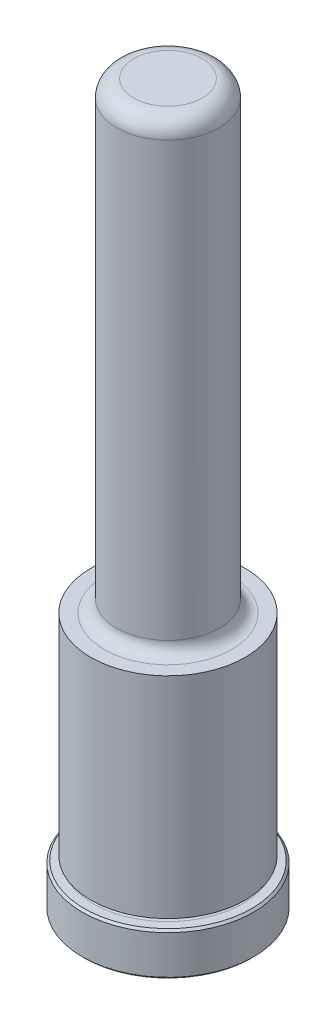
ISO-10303-21;
HEADER;
FILE_DESCRIPTION(('STEP AP214'),'2;1');
FILE_NAME('part.step','',(''),(''),'','','');
FILE_SCHEMA(('AUTOMOTIVE_DESIGN { 1 0 10303 214 1 1 1 1 }'));
ENDSEC;
DATA;
#1=APPLICATION_CONTEXT('core data for automotive mechanical design processes');
#2=APPLICATION_PROTOCOL_DEFINITION('international standard','automotive_design',2000,#1);
#3=PRODUCT_CONTEXT('',#1,'mechanical');
#4=PRODUCT('Part','Part','',(#3));
#5=PRODUCT_RELATED_PRODUCT_CATEGORY('part','',(#4));
#6=PRODUCT_DEFINITION_FORMATION('','',#4);
#7=PRODUCT_DEFINITION_CONTEXT('part definition',#1,'design');
#8=PRODUCT_DEFINITION('design','',#6,#7);
#9=PRODUCT_DEFINITION_SHAPE('','',#8);
#10=(LENGTH_UNIT() NAMED_UNIT(*) SI_UNIT(.MILLI.,.METRE.));
#11=(NAMED_UNIT(*) PLANE_ANGLE_UNIT() SI_UNIT($,.RADIAN.));
#12=(NAMED_UNIT(*) SI_UNIT($,.STERADIAN.) SOLID_ANGLE_UNIT());
#13=UNCERTAINTY_MEASURE_WITH_UNIT(LENGTH_MEASURE(1.E-05),#10,'distance_accuracy_value','');
#14=(GEOMETRIC_REPRESENTATION_CONTEXT(3) GLOBAL_UNCERTAINTY_ASSIGNED_CONTEXT((#13)) GLOBAL_UNIT_ASSIGNED_CONTEXT((#10,
#11,#12)) REPRESENTATION_CONTEXT('',''));
#15=CARTESIAN_POINT('',(0.,0.,0.));
#16=DIRECTION('',(0.,0.,1.));
#17=DIRECTION('',(1.,0.,0.));
#18=AXIS2_PLACEMENT_3D('',#15,#16,#17);
#19=CARTESIAN_POINT('',(0.,0.,0.));
#20=DIRECTION('',(0.,1.,0.));
#21=DIRECTION('',(0.,0.,1.));
#22=AXIS2_PLACEMENT_3D('',#19,#20,#21);
#23=PLANE('',#22);
#24=CARTESIAN_POINT('',(0.,0.,0.));
#25=DIRECTION('',(0.,1.,0.));
#26=DIRECTION('',(0.,0.,1.));
#27=AXIS2_PLACEMENT_3D('',#24,#25,#26);
#28=CIRCLE('',#27,15.494);
#29=CARTESIAN_POINT('',(0.,0.,15.494));
#30=VERTEX_POINT('',#29);
#31=EDGE_CURVE('E46',#30,#30,#28,.F.);
#32=ORIENTED_EDGE('',*,*,#31,.T.);
#33=EDGE_LOOP('',(#32));
#34=FACE_BOUND('',#33,.T.);
#35=ADVANCED_FACE('F31',(#34),#23,.F.);
#36=CARTESIAN_POINT('',(0.,0.,0.));
#37=DIRECTION('',(0.,1.,0.));
#38=DIRECTION('',(0.,0.,1.));
#39=AXIS2_PLACEMENT_3D('',#36,#37,#38);
#40=CYLINDRICAL_SURFACE('',#39,15.875);
#41=CARTESIAN_POINT('',(0.,0.380999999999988,0.));
#42=DIRECTION('',(0.,1.,0.));
#43=DIRECTION('',(0.,0.,1.));
#44=AXIS2_PLACEMENT_3D('',#41,#42,#43);
#45=CIRCLE('',#44,15.875);
#46=CARTESIAN_POINT('',(0.,0.380999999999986,15.875));
#47=VERTEX_POINT('',#46);
#48=EDGE_CURVE('E51',#47,#47,#45,.T.);
#49=ORIENTED_EDGE('',*,*,#48,.T.);
#50=EDGE_LOOP('',(#49));
#51=FACE_BOUND('',#50,.T.);
#52=CARTESIAN_POINT('',(0.,7.54380000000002,0.));
#53=DIRECTION('',(0.,-1.,0.));
#54=DIRECTION('',(0.,0.,-1.));
#55=AXIS2_PLACEMENT_3D('',#52,#53,#54);
#56=CIRCLE('',#55,15.875);
#57=CARTESIAN_POINT('',(0.,7.54380000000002,-15.875));
#58=VERTEX_POINT('',#57);
#59=EDGE_CURVE('E54',#58,#58,#56,.T.);
#60=ORIENTED_EDGE('',*,*,#59,.T.);
#61=EDGE_LOOP('',(#60));
#62=FACE_BOUND('',#61,.T.);
#63=ADVANCED_FACE('F110',(#51,#62),#40,.T.);
#64=CARTESIAN_POINT('',(0.,7.9248,-15.875));
#65=DIRECTION('',(0.,-1.,0.));
#66=DIRECTION('',(0.,0.,-1.));
#67=AXIS2_PLACEMENT_3D('',#64,#65,#66);
#68=PLANE('',#67);
#69=CARTESIAN_POINT('',(0.,7.9248,0.));
#70=DIRECTION('',(0.,-1.,0.));
#71=DIRECTION('',(0.,0.,-1.));
#72=AXIS2_PLACEMENT_3D('',#69,#70,#71);
#73=CIRCLE('',#72,15.494);
#74=CARTESIAN_POINT('',(0.,7.9248,-15.494));
#75=VERTEX_POINT('',#74);
#76=EDGE_CURVE('E42',#75,#75,#73,.F.);
#77=ORIENTED_EDGE('',*,*,#76,.T.);
#78=EDGE_LOOP('',(#77));
#79=FACE_BOUND('',#78,.T.);
#80=CARTESIAN_POINT('',(0.,7.9248,0.));
#81=DIRECTION('',(0.,1.,0.));
#82=DIRECTION('',(0.,0.,1.));
#83=AXIS2_PLACEMENT_3D('',#80,#81,#82);
#84=CIRCLE('',#83,13.8938);
#85=CARTESIAN_POINT('',(0.,7.9248,13.8938));
#86=VERTEX_POINT('',#85);
#87=EDGE_CURVE('E57',#86,#86,#84,.T.);
#88=ORIENTED_EDGE('',*,*,#87,.F.);
#89=EDGE_LOOP('',(#88));
#90=FACE_BOUND('',#89,.T.);
#91=ADVANCED_FACE('F105',(#79,#90),#68,.F.);
#92=CARTESIAN_POINT('',(0.,8.3058,0.));
#93=DIRECTION('',(0.,1.,0.));
#94=DIRECTION('',(0.,0.,1.));
#95=AXIS2_PLACEMENT_3D('',#92,#93,#94);
#96=TOROIDAL_SURFACE('',#95,13.8938,0.381000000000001);
#97=CARTESIAN_POINT('',(0.,8.68680000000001,0.));
#98=DIRECTION('',(0.,1.,0.));
#99=DIRECTION('',(0.,0.,1.));
#100=AXIS2_PLACEMENT_3D('',#97,#98,#99);
#101=CIRCLE('',#100,13.8938);
#102=CARTESIAN_POINT('',(0.,8.6868,13.8938));
#103=VERTEX_POINT('',#102);
#104=EDGE_CURVE('E60',#103,#103,#101,.T.);
#105=ORIENTED_EDGE('',*,*,#104,.F.);
#106=EDGE_LOOP('',(#105));
#107=FACE_BOUND('',#106,.T.);
#108=ORIENTED_EDGE('',*,*,#87,.T.);
#109=EDGE_LOOP('',(#108));
#110=FACE_BOUND('',#109,.T.);
#111=ADVANCED_FACE('F99',(#107,#110),#96,.F.);
#112=CARTESIAN_POINT('',(0.,8.68680000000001,-13.8938));
#113=DIRECTION('',(0.,1.,0.));
#114=DIRECTION('',(0.,0.,1.));
#115=AXIS2_PLACEMENT_3D('',#112,#113,#114);
#116=PLANE('',#115);
#117=CARTESIAN_POINT('',(0.,8.6868,0.));
#118=DIRECTION('',(0.,1.,0.));
#119=DIRECTION('',(0.,0.,1.));
#120=AXIS2_PLACEMENT_3D('',#117,#118,#119);
#121=CIRCLE('',#120,14.3002);
#122=CARTESIAN_POINT('',(0.,8.6868,14.3002));
#123=VERTEX_POINT('',#122);
#124=EDGE_CURVE('E63',#123,#123,#121,.T.);
#125=ORIENTED_EDGE('',*,*,#124,.F.);
#126=EDGE_LOOP('',(#125));
#127=FACE_BOUND('',#126,.T.);
#128=ORIENTED_EDGE('',*,*,#104,.T.);
#129=EDGE_LOOP('',(#128));
#130=FACE_BOUND('',#129,.T.);
#131=ADVANCED_FACE('F93',(#127,#130),#116,.F.);
#132=CARTESIAN_POINT('',(0.,0.,0.));
#133=DIRECTION('',(0.,1.,0.));
#134=DIRECTION('',(0.,0.,1.));
#135=AXIS2_PLACEMENT_3D('',#132,#133,#134);
#136=CYLINDRICAL_SURFACE('',#135,14.3002);
#137=CARTESIAN_POINT('',(0.,47.625,0.));
#138=DIRECTION('',(0.,1.,0.));
#139=DIRECTION('',(0.,0.,1.));
#140=AXIS2_PLACEMENT_3D('',#137,#138,#139);
#141=CIRCLE('',#140,14.3002);
#142=CARTESIAN_POINT('',(0.,47.625,14.3002));
#143=VERTEX_POINT('',#142);
#144=EDGE_CURVE('E66',#143,#143,#141,.T.);
#145=ORIENTED_EDGE('',*,*,#144,.F.);
#146=EDGE_LOOP('',(#145));
#147=FACE_BOUND('',#146,.T.);
#148=ORIENTED_EDGE('',*,*,#124,.T.);
#149=EDGE_LOOP('',(#148));
#150=FACE_BOUND('',#149,.T.);
#151=ADVANCED_FACE('F87',(#147,#150),#136,.T.);
#152=CARTESIAN_POINT('',(0.,47.625,-14.3002));
#153=DIRECTION('',(0.,-1.,0.));
#154=DIRECTION('',(0.,0.,-1.));
#155=AXIS2_PLACEMENT_3D('',#152,#153,#154);
#156=PLANE('',#155);
#157=CARTESIAN_POINT('',(0.,47.625,0.));
#158=DIRECTION('',(0.,1.,0.));
#159=DIRECTION('',(0.,0.,1.));
#160=AXIS2_PLACEMENT_3D('',#157,#158,#159);
#161=CIRCLE('',#160,11.7983);
#162=CARTESIAN_POINT('',(0.,47.625,11.7983));
#163=VERTEX_POINT('',#162);
#164=EDGE_CURVE('E69',#163,#163,#161,.T.);
#165=ORIENTED_EDGE('',*,*,#164,.F.);
#166=EDGE_LOOP('',(#165));
#167=FACE_BOUND('',#166,.T.);
#168=ORIENTED_EDGE('',*,*,#144,.T.);
#169=EDGE_LOOP('',(#168));
#170=FACE_BOUND('',#169,.T.);
#171=ADVANCED_FACE('F81',(#167,#170),#156,.F.);
#172=CARTESIAN_POINT('',(0.,49.911,0.));
#173=DIRECTION('',(0.,1.,0.));
#174=DIRECTION('',(0.,0.,1.));
#175=AXIS2_PLACEMENT_3D('',#172,#173,#174);
#176=TOROIDAL_SURFACE('',#175,11.7983,2.286);
#177=CARTESIAN_POINT('',(0.,49.911,0.));
#178=DIRECTION('',(0.,1.,0.));
#179=DIRECTION('',(0.,0.,1.));
#180=AXIS2_PLACEMENT_3D('',#177,#178,#179);
#181=CIRCLE('',#180,9.5123);
#182=CARTESIAN_POINT('',(0.,49.911,9.5123));
#183=VERTEX_POINT('',#182);
#184=EDGE_CURVE('E72',#183,#183,#181,.T.);
#185=ORIENTED_EDGE('',*,*,#184,.F.);
#186=EDGE_LOOP('',(#185));
#187=FACE_BOUND('',#186,.T.);
#188=ORIENTED_EDGE('',*,*,#164,.T.);
#189=EDGE_LOOP('',(#188));
#190=FACE_BOUND('',#189,.T.);
#191=ADVANCED_FACE('F78',(#187,#190),#176,.F.);
#192=CARTESIAN_POINT('',(0.,0.,0.));
#193=DIRECTION('',(0.,1.,0.));
#194=DIRECTION('',(0.,0.,1.));
#195=AXIS2_PLACEMENT_3D('',#192,#193,#194);
#196=CYLINDRICAL_SURFACE('',#195,9.5123);
#197=CARTESIAN_POINT('',(0.,130.175,0.));
#198=DIRECTION('',(0.,-1.,0.));
#199=DIRECTION('',(0.,0.,-1.));
#200=AXIS2_PLACEMENT_3D('',#197,#198,#199);
#201=CIRCLE('',#200,9.5123);
#202=CARTESIAN_POINT('',(0.,130.175,-9.51229999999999));
#203=VERTEX_POINT('',#202);
#204=EDGE_CURVE('E10',#203,#203,#201,.T.);
#205=ORIENTED_EDGE('',*,*,#204,.T.);
#206=EDGE_LOOP('',(#205));
#207=FACE_BOUND('',#206,.T.);
#208=ORIENTED_EDGE('',*,*,#184,.T.);
#209=EDGE_LOOP('',(#208));
#210=FACE_BOUND('',#209,.T.);
#211=ADVANCED_FACE('F76',(#207,#210),#196,.T.);
#212=CARTESIAN_POINT('',(0.,133.35,-9.51229999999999));
#213=DIRECTION('',(0.,-1.,0.));
#214=DIRECTION('',(0.,0.,-1.));
#215=AXIS2_PLACEMENT_3D('',#212,#213,#214);
#216=PLANE('',#215);
#217=CARTESIAN_POINT('',(0.,133.35,0.));
#218=DIRECTION('',(0.,-1.,0.));
#219=DIRECTION('',(0.,0.,-1.));
#220=AXIS2_PLACEMENT_3D('',#217,#218,#219);
#221=CIRCLE('',#220,6.3373);
#222=CARTESIAN_POINT('',(0.,133.35,-6.33729999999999));
#223=VERTEX_POINT('',#222);
#224=EDGE_CURVE('E38',#223,#223,#221,.F.);
#225=ORIENTED_EDGE('',*,*,#224,.T.);
#226=EDGE_LOOP('',(#225));
#227=FACE_BOUND('',#226,.T.);
#228=ADVANCED_FACE('F127',(#227),#216,.F.);
#229=CARTESIAN_POINT('',(0.,0.380999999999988,0.));
#230=DIRECTION('',(0.,1.,0.));
#231=DIRECTION('',(0.,0.,1.));
#232=AXIS2_PLACEMENT_3D('',#229,#230,#231);
#233=CONICAL_SURFACE('',#232,15.875,0.785398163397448);
#234=ORIENTED_EDGE('',*,*,#31,.F.);
#235=EDGE_LOOP('',(#234));
#236=FACE_BOUND('',#235,.T.);
#237=ORIENTED_EDGE('',*,*,#48,.F.);
#238=EDGE_LOOP('',(#237));
#239=FACE_BOUND('',#238,.T.);
#240=ADVANCED_FACE('F124',(#236,#239),#233,.T.);
#241=CARTESIAN_POINT('',(0.,7.9248,0.));
#242=DIRECTION('',(0.,-1.,0.));
#243=DIRECTION('',(0.,0.,-1.));
#244=AXIS2_PLACEMENT_3D('',#241,#242,#243);
#245=CONICAL_SURFACE('',#244,15.494,0.785398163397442);
#246=ORIENTED_EDGE('',*,*,#59,.F.);
#247=EDGE_LOOP('',(#246));
#248=FACE_BOUND('',#247,.T.);
#249=ORIENTED_EDGE('',*,*,#76,.F.);
#250=EDGE_LOOP('',(#249));
#251=FACE_BOUND('',#250,.T.);
#252=ADVANCED_FACE('F126',(#248,#251),#245,.T.);
#253=CARTESIAN_POINT('',(0.,130.175,0.));
#254=DIRECTION('',(0.,-1.,0.));
#255=DIRECTION('',(0.,0.,-1.));
#256=AXIS2_PLACEMENT_3D('',#253,#254,#255);
#257=TOROIDAL_SURFACE('',#256,6.3373,3.175);
#258=ORIENTED_EDGE('',*,*,#204,.F.);
#259=EDGE_LOOP('',(#258));
#260=FACE_BOUND('',#259,.T.);
#261=ORIENTED_EDGE('',*,*,#224,.F.);
#262=EDGE_LOOP('',(#261));
#263=FACE_BOUND('',#262,.T.);
#264=ADVANCED_FACE('F33',(#260,#263),#257,.T.);
#265=CLOSED_SHELL('',(#35,#63,#91,#111,#131,#151,#171,#191,#211,#228,#240,#252,#264));
#266=MANIFOLD_SOLID_BREP('B2',#265);
#267=ADVANCED_BREP_SHAPE_REPRESENTATION('',(#18,#266),#14);
#268=SHAPE_DEFINITION_REPRESENTATION(#9,#267);
ENDSEC;
END-ISO-10303-21;
